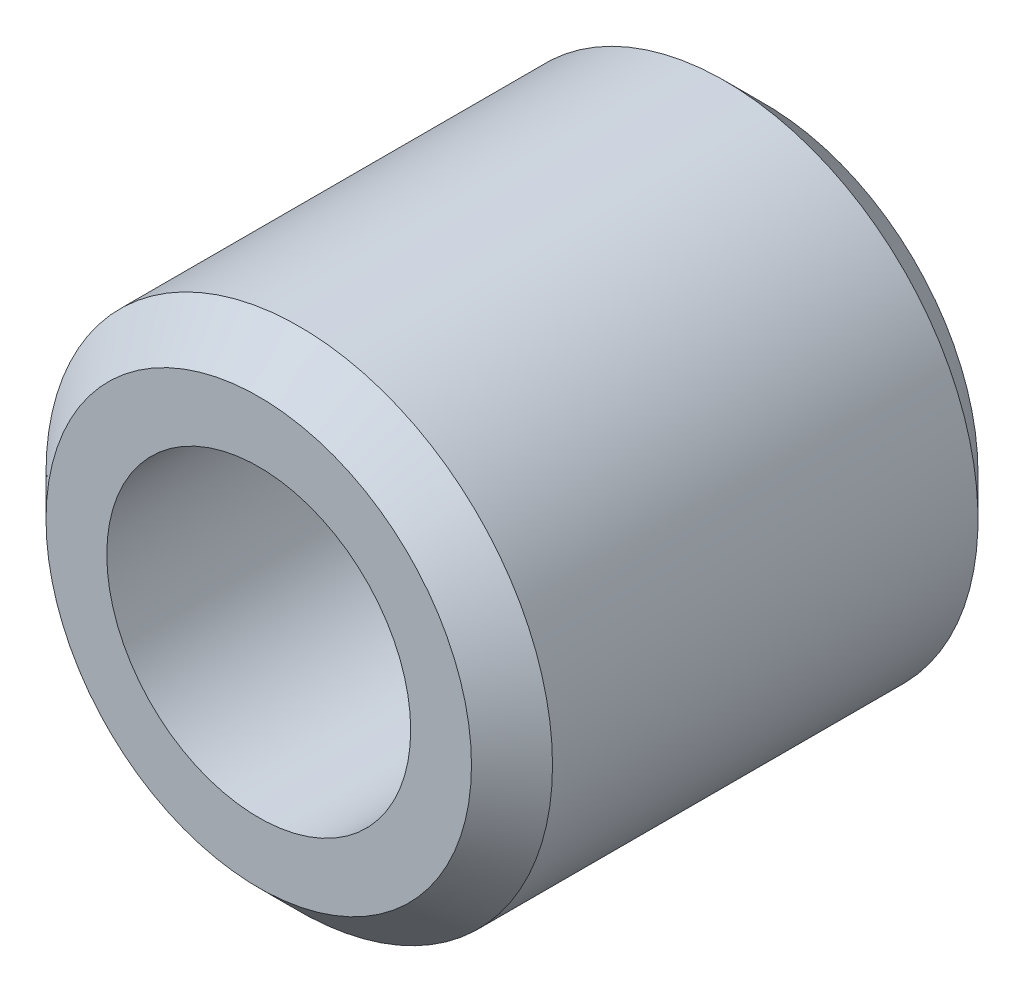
ISO-10303-21;
HEADER;
FILE_DESCRIPTION(('STEP AP214'),'2;1');
FILE_NAME('part.step','',(''),(''),'','','');
FILE_SCHEMA(('AUTOMOTIVE_DESIGN { 1 0 10303 214 1 1 1 1 }'));
ENDSEC;
DATA;
#1=APPLICATION_CONTEXT('core data for automotive mechanical design processes');
#2=APPLICATION_PROTOCOL_DEFINITION('international standard','automotive_design',2000,#1);
#3=PRODUCT_CONTEXT('',#1,'mechanical');
#4=PRODUCT('Part','Part','',(#3));
#5=PRODUCT_RELATED_PRODUCT_CATEGORY('part','',(#4));
#6=PRODUCT_DEFINITION_FORMATION('','',#4);
#7=PRODUCT_DEFINITION_CONTEXT('part definition',#1,'design');
#8=PRODUCT_DEFINITION('design','',#6,#7);
#9=PRODUCT_DEFINITION_SHAPE('','',#8);
#10=(LENGTH_UNIT() NAMED_UNIT(*) SI_UNIT(.MILLI.,.METRE.));
#11=(NAMED_UNIT(*) PLANE_ANGLE_UNIT() SI_UNIT($,.RADIAN.));
#12=(NAMED_UNIT(*) SI_UNIT($,.STERADIAN.) SOLID_ANGLE_UNIT());
#13=UNCERTAINTY_MEASURE_WITH_UNIT(LENGTH_MEASURE(1.E-05),#10,'distance_accuracy_value','');
#14=(GEOMETRIC_REPRESENTATION_CONTEXT(3) GLOBAL_UNCERTAINTY_ASSIGNED_CONTEXT((#13)) GLOBAL_UNIT_ASSIGNED_CONTEXT((#10,
#11,#12)) REPRESENTATION_CONTEXT('',''));
#15=CARTESIAN_POINT('',(0.,0.,0.));
#16=DIRECTION('',(0.,0.,1.));
#17=DIRECTION('',(1.,0.,0.));
#18=AXIS2_PLACEMENT_3D('',#15,#16,#17);
#19=CARTESIAN_POINT('',(0.,0.,0.));
#20=DIRECTION('',(0.,0.,-1.));
#21=DIRECTION('',(-1.,0.,0.));
#22=AXIS2_PLACEMENT_3D('',#19,#20,#21);
#23=CYLINDRICAL_SURFACE('',#22,3.);
#24=CARTESIAN_POINT('',(0.,0.,0.));
#25=DIRECTION('',(0.,0.,-1.));
#26=DIRECTION('',(-1.,0.,0.));
#27=AXIS2_PLACEMENT_3D('',#24,#25,#26);
#28=CIRCLE('',#27,3.);
#29=CARTESIAN_POINT('',(-3.,0.,0.));
#30=VERTEX_POINT('',#29);
#31=EDGE_CURVE('E34',#30,#30,#28,.T.);
#32=ORIENTED_EDGE('',*,*,#31,.T.);
#33=EDGE_LOOP('',(#32));
#34=FACE_BOUND('',#33,.T.);
#35=CARTESIAN_POINT('',(0.,0.,10.));
#36=DIRECTION('',(0.,0.,-1.));
#37=DIRECTION('',(-1.,0.,0.));
#38=AXIS2_PLACEMENT_3D('',#35,#36,#37);
#39=CIRCLE('',#38,3.);
#40=CARTESIAN_POINT('',(-3.,0.,10.));
#41=VERTEX_POINT('',#40);
#42=EDGE_CURVE('E31',#41,#41,#39,.T.);
#43=ORIENTED_EDGE('',*,*,#42,.F.);
#44=EDGE_LOOP('',(#43));
#45=FACE_BOUND('',#44,.T.);
#46=ADVANCED_FACE('F12',(#34,#45),#23,.F.);
#47=CARTESIAN_POINT('',(-3.,0.,10.));
#48=DIRECTION('',(0.,0.,1.));
#49=DIRECTION('',(1.,0.,0.));
#50=AXIS2_PLACEMENT_3D('',#47,#48,#49);
#51=PLANE('',#50);
#52=CARTESIAN_POINT('',(0.,0.,10.));
#53=DIRECTION('',(0.,0.,1.));
#54=DIRECTION('',(1.,0.,0.));
#55=AXIS2_PLACEMENT_3D('',#52,#53,#54);
#56=CIRCLE('',#55,4.2);
#57=CARTESIAN_POINT('',(4.2,0.,10.));
#58=VERTEX_POINT('',#57);
#59=EDGE_CURVE('E8',#58,#58,#56,.T.);
#60=ORIENTED_EDGE('',*,*,#59,.T.);
#61=EDGE_LOOP('',(#60));
#62=FACE_BOUND('',#61,.T.);
#63=ORIENTED_EDGE('',*,*,#42,.T.);
#64=EDGE_LOOP('',(#63));
#65=FACE_BOUND('',#64,.T.);
#66=ADVANCED_FACE('F55',(#62,#65),#51,.T.);
#67=CARTESIAN_POINT('',(0.,0.,0.));
#68=DIRECTION('',(0.,0.,-1.));
#69=DIRECTION('',(-1.,0.,0.));
#70=AXIS2_PLACEMENT_3D('',#67,#68,#69);
#71=CYLINDRICAL_SURFACE('',#70,5.);
#72=CARTESIAN_POINT('',(0.,0.,0.799999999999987));
#73=DIRECTION('',(0.,0.,-1.));
#74=DIRECTION('',(-1.,0.,0.));
#75=AXIS2_PLACEMENT_3D('',#72,#73,#74);
#76=CIRCLE('',#75,5.);
#77=CARTESIAN_POINT('',(-5.,0.,0.799999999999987));
#78=VERTEX_POINT('',#77);
#79=EDGE_CURVE('E18',#78,#78,#76,.F.);
#80=ORIENTED_EDGE('',*,*,#79,.T.);
#81=EDGE_LOOP('',(#80));
#82=FACE_BOUND('',#81,.T.);
#83=CARTESIAN_POINT('',(0.,0.,9.2));
#84=DIRECTION('',(0.,0.,1.));
#85=DIRECTION('',(1.,0.,0.));
#86=AXIS2_PLACEMENT_3D('',#83,#84,#85);
#87=CIRCLE('',#86,5.);
#88=CARTESIAN_POINT('',(5.,0.,9.2));
#89=VERTEX_POINT('',#88);
#90=EDGE_CURVE('E22',#89,#89,#87,.F.);
#91=ORIENTED_EDGE('',*,*,#90,.T.);
#92=EDGE_LOOP('',(#91));
#93=FACE_BOUND('',#92,.T.);
#94=ADVANCED_FACE('F43',(#82,#93),#71,.T.);
#95=CARTESIAN_POINT('',(-3.,0.,0.));
#96=DIRECTION('',(0.,0.,-1.));
#97=DIRECTION('',(-1.,0.,0.));
#98=AXIS2_PLACEMENT_3D('',#95,#96,#97);
#99=PLANE('',#98);
#100=CARTESIAN_POINT('',(0.,0.,0.));
#101=DIRECTION('',(0.,0.,-1.));
#102=DIRECTION('',(-1.,0.,0.));
#103=AXIS2_PLACEMENT_3D('',#100,#101,#102);
#104=CIRCLE('',#103,4.2);
#105=CARTESIAN_POINT('',(-4.2,0.,0.));
#106=VERTEX_POINT('',#105);
#107=EDGE_CURVE('E26',#106,#106,#104,.T.);
#108=ORIENTED_EDGE('',*,*,#107,.T.);
#109=EDGE_LOOP('',(#108));
#110=FACE_BOUND('',#109,.T.);
#111=ORIENTED_EDGE('',*,*,#31,.F.);
#112=EDGE_LOOP('',(#111));
#113=FACE_BOUND('',#112,.T.);
#114=ADVANCED_FACE('F40',(#110,#113),#99,.T.);
#115=CARTESIAN_POINT('',(0.,0.,0.));
#116=DIRECTION('',(0.,0.,1.));
#117=DIRECTION('',(1.,0.,0.));
#118=AXIS2_PLACEMENT_3D('',#115,#116,#117);
#119=CONICAL_SURFACE('',#118,4.2,0.785398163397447);
#120=ORIENTED_EDGE('',*,*,#79,.F.);
#121=EDGE_LOOP('',(#120));
#122=FACE_BOUND('',#121,.T.);
#123=ORIENTED_EDGE('',*,*,#107,.F.);
#124=EDGE_LOOP('',(#123));
#125=FACE_BOUND('',#124,.T.);
#126=ADVANCED_FACE('F42',(#122,#125),#119,.T.);
#127=CARTESIAN_POINT('',(0.,0.,9.2));
#128=DIRECTION('',(0.,0.,-1.));
#129=DIRECTION('',(-1.,0.,0.));
#130=AXIS2_PLACEMENT_3D('',#127,#128,#129);
#131=CONICAL_SURFACE('',#130,5.,0.78539816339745);
#132=ORIENTED_EDGE('',*,*,#59,.F.);
#133=EDGE_LOOP('',(#132));
#134=FACE_BOUND('',#133,.T.);
#135=ORIENTED_EDGE('',*,*,#90,.F.);
#136=EDGE_LOOP('',(#135));
#137=FACE_BOUND('',#136,.T.);
#138=ADVANCED_FACE('F52',(#134,#137),#131,.T.);
#139=CLOSED_SHELL('',(#46,#66,#94,#114,#126,#138));
#140=MANIFOLD_SOLID_BREP('B1',#139);
#141=ADVANCED_BREP_SHAPE_REPRESENTATION('',(#18,#140),#14);
#142=SHAPE_DEFINITION_REPRESENTATION(#9,#141);
ENDSEC;
END-ISO-10303-21;
